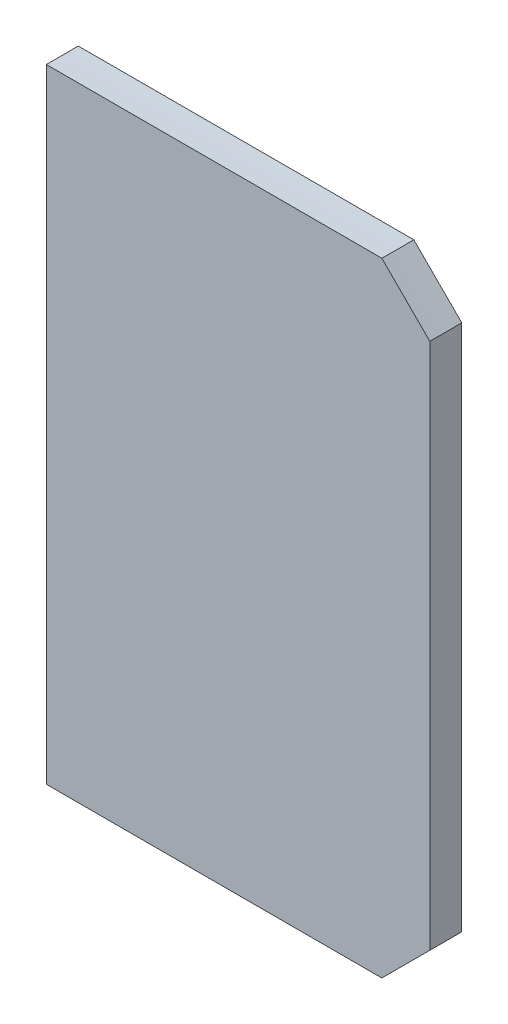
ISO-10303-21;
HEADER;
FILE_DESCRIPTION(('STEP AP214'),'2;1');
FILE_NAME('part.step','',(''),(''),'','','');
FILE_SCHEMA(('AUTOMOTIVE_DESIGN { 1 0 10303 214 1 1 1 1 }'));
ENDSEC;
DATA;
#1=APPLICATION_CONTEXT('core data for automotive mechanical design processes');
#2=APPLICATION_PROTOCOL_DEFINITION('international standard','automotive_design',2000,#1);
#3=PRODUCT_CONTEXT('',#1,'mechanical');
#4=PRODUCT('Part','Part','',(#3));
#5=PRODUCT_RELATED_PRODUCT_CATEGORY('part','',(#4));
#6=PRODUCT_DEFINITION_FORMATION('','',#4);
#7=PRODUCT_DEFINITION_CONTEXT('part definition',#1,'design');
#8=PRODUCT_DEFINITION('design','',#6,#7);
#9=PRODUCT_DEFINITION_SHAPE('','',#8);
#10=(LENGTH_UNIT() NAMED_UNIT(*) SI_UNIT(.MILLI.,.METRE.));
#11=(NAMED_UNIT(*) PLANE_ANGLE_UNIT() SI_UNIT($,.RADIAN.));
#12=(NAMED_UNIT(*) SI_UNIT($,.STERADIAN.) SOLID_ANGLE_UNIT());
#13=UNCERTAINTY_MEASURE_WITH_UNIT(LENGTH_MEASURE(1.E-05),#10,'distance_accuracy_value','');
#14=(GEOMETRIC_REPRESENTATION_CONTEXT(3) GLOBAL_UNCERTAINTY_ASSIGNED_CONTEXT((#13)) GLOBAL_UNIT_ASSIGNED_CONTEXT((#10,
#11,#12)) REPRESENTATION_CONTEXT('',''));
#15=CARTESIAN_POINT('',(0.,0.,0.));
#16=DIRECTION('',(0.,0.,1.));
#17=DIRECTION('',(1.,0.,0.));
#18=AXIS2_PLACEMENT_3D('',#15,#16,#17);
#19=CARTESIAN_POINT('',(275.,-510.,5.));
#20=DIRECTION('',(0.,1.,0.));
#21=DIRECTION('',(0.,0.,1.));
#22=AXIS2_PLACEMENT_3D('',#19,#20,#21);
#23=PLANE('',#22);
#24=DIRECTION('',(-1.,0.,0.));
#25=VECTOR('',#24,1.);
#26=CARTESIAN_POINT('',(275.,-510.,-5.));
#27=LINE('',#26,#25);
#28=CARTESIAN_POINT('',(380.,-510.,-5.));
#29=VERTEX_POINT('',#28);
#30=CARTESIAN_POINT('',(275.,-510.,-5.));
#31=VERTEX_POINT('',#30);
#32=EDGE_CURVE('E116',#29,#31,#27,.T.);
#33=ORIENTED_EDGE('',*,*,#32,.F.);
#34=DIRECTION('',(0.,0.,1.));
#35=VECTOR('',#34,1.);
#36=CARTESIAN_POINT('',(380.,-510.,5.));
#37=LINE('',#36,#35);
#38=CARTESIAN_POINT('',(380.,-510.,5.));
#39=VERTEX_POINT('',#38);
#40=EDGE_CURVE('E13',#29,#39,#37,.T.);
#41=ORIENTED_EDGE('',*,*,#40,.T.);
#42=DIRECTION('',(1.,0.,0.));
#43=VECTOR('',#42,1.);
#44=CARTESIAN_POINT('',(275.,-510.,5.));
#45=LINE('',#44,#43);
#46=CARTESIAN_POINT('',(275.,-510.,5.));
#47=VERTEX_POINT('',#46);
#48=EDGE_CURVE('E102',#47,#39,#45,.T.);
#49=ORIENTED_EDGE('',*,*,#48,.F.);
#50=DIRECTION('',(0.,0.,1.));
#51=VECTOR('',#50,1.);
#52=CARTESIAN_POINT('',(275.,-510.,-5.));
#53=LINE('',#52,#51);
#54=EDGE_CURVE('E114',#31,#47,#53,.T.);
#55=ORIENTED_EDGE('',*,*,#54,.F.);
#56=EDGE_LOOP('',(#33,#41,#49,#55));
#57=FACE_BOUND('',#56,.T.);
#58=ADVANCED_FACE('F45',(#57),#23,.F.);
#59=CARTESIAN_POINT('',(275.,-133.123752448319,-5.));
#60=DIRECTION('',(0.,0.,1.));
#61=DIRECTION('',(1.,0.,0.));
#62=AXIS2_PLACEMENT_3D('',#59,#60,#61);
#63=PLANE('',#62);
#64=DIRECTION('',(1.,0.,0.));
#65=VECTOR('',#64,1.);
#66=CARTESIAN_POINT('',(260.,-314.960314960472,-5.));
#67=LINE('',#66,#65);
#68=CARTESIAN_POINT('',(275.,-314.960314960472,-5.));
#69=VERTEX_POINT('',#68);
#70=CARTESIAN_POINT('',(380.,-314.960314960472,-5.));
#71=VERTEX_POINT('',#70);
#72=EDGE_CURVE('E109',#69,#71,#67,.T.);
#73=ORIENTED_EDGE('',*,*,#72,.T.);
#74=CARTESIAN_POINT('',(380.,-314.960314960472,-5.));
#75=CARTESIAN_POINT('',(382.49999300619,-317.460622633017,-5.));
#76=CARTESIAN_POINT('',(384.999989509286,-319.960926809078,-5.));
#77=CARTESIAN_POINT('',(389.999989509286,-324.96152816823,-5.00000000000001));
#78=CARTESIAN_POINT('',(392.49999300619,-327.461825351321,-5.00000000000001));
#79=CARTESIAN_POINT('',(395.,-329.962119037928,-5.));
#80=B_SPLINE_CURVE_WITH_KNOTS('',3,(#74,#75,#76,#77,#78,#79),.UNSPECIFIED.,.F.,.F.,(4,2,4),(0.,
10.6072395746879,21.2144791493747),.UNSPECIFIED.);
#81=CARTESIAN_POINT('',(395.,-329.962119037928,-5.));
#82=VERTEX_POINT('',#81);
#83=EDGE_CURVE('E53',#71,#82,#80,.T.);
#84=ORIENTED_EDGE('',*,*,#83,.T.);
#85=DIRECTION('',(0.,-1.,0.));
#86=VECTOR('',#85,1.);
#87=CARTESIAN_POINT('',(395.,-133.123752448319,-5.));
#88=LINE('',#87,#86);
#89=CARTESIAN_POINT('',(395.,-495.,-5.));
#90=VERTEX_POINT('',#89);
#91=EDGE_CURVE('E129',#82,#90,#88,.T.);
#92=ORIENTED_EDGE('',*,*,#91,.T.);
#93=DIRECTION('',(0.707106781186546,0.707106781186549,0.));
#94=VECTOR('',#93,1.);
#95=CARTESIAN_POINT('',(395.,-495.,-5.));
#96=LINE('',#95,#94);
#97=EDGE_CURVE('E60',#90,#29,#96,.F.);
#98=ORIENTED_EDGE('',*,*,#97,.T.);
#99=ORIENTED_EDGE('',*,*,#32,.T.);
#100=DIRECTION('',(0.,-1.,0.));
#101=VECTOR('',#100,1.);
#102=CARTESIAN_POINT('',(275.,-133.123752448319,-5.));
#103=LINE('',#102,#101);
#104=EDGE_CURVE('E121',#69,#31,#103,.T.);
#105=ORIENTED_EDGE('',*,*,#104,.F.);
#106=EDGE_LOOP('',(#73,#84,#92,#98,#99,#105));
#107=FACE_BOUND('',#106,.T.);
#108=ADVANCED_FACE('F164',(#107),#63,.F.);
#109=CARTESIAN_POINT('',(395.,-133.123752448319,-5.));
#110=DIRECTION('',(-1.,0.,0.));
#111=DIRECTION('',(0.,0.,1.));
#112=AXIS2_PLACEMENT_3D('',#109,#110,#111);
#113=PLANE('',#112);
#114=ORIENTED_EDGE('',*,*,#91,.F.);
#115=CARTESIAN_POINT('',(395.,0.,0.));
#116=DIRECTION('',(-1.,0.,0.));
#117=DIRECTION('',(0.,0.,1.));
#118=AXIS2_PLACEMENT_3D('',#115,#116,#117);
#119=CIRCLE('',#118,330.);
#120=CARTESIAN_POINT('',(395.,-329.962119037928,5.));
#121=VERTEX_POINT('',#120);
#122=EDGE_CURVE('E137',#82,#121,#119,.T.);
#123=ORIENTED_EDGE('',*,*,#122,.T.);
#124=DIRECTION('',(0.,-1.,0.));
#125=VECTOR('',#124,1.);
#126=CARTESIAN_POINT('',(395.,-133.123752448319,5.));
#127=LINE('',#126,#125);
#128=CARTESIAN_POINT('',(395.,-495.,5.));
#129=VERTEX_POINT('',#128);
#130=EDGE_CURVE('E110',#121,#129,#127,.T.);
#131=ORIENTED_EDGE('',*,*,#130,.T.);
#132=DIRECTION('',(0.,0.,-1.));
#133=VECTOR('',#132,1.);
#134=CARTESIAN_POINT('',(395.,-495.,-5.));
#135=LINE('',#134,#133);
#136=EDGE_CURVE('E134',#129,#90,#135,.T.);
#137=ORIENTED_EDGE('',*,*,#136,.T.);
#138=EDGE_LOOP('',(#114,#123,#131,#137));
#139=FACE_BOUND('',#138,.T.);
#140=ADVANCED_FACE('F155',(#139),#113,.F.);
#141=CARTESIAN_POINT('',(275.,-133.123752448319,5.));
#142=DIRECTION('',(0.,0.,-1.));
#143=DIRECTION('',(-1.,0.,0.));
#144=AXIS2_PLACEMENT_3D('',#141,#142,#143);
#145=PLANE('',#144);
#146=ORIENTED_EDGE('',*,*,#130,.F.);
#147=CARTESIAN_POINT('',(395.,-329.962119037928,5.));
#148=CARTESIAN_POINT('',(392.49999300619,-327.461825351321,5.));
#149=CARTESIAN_POINT('',(389.999989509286,-324.96152816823,5.));
#150=CARTESIAN_POINT('',(384.999989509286,-319.960926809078,5.));
#151=CARTESIAN_POINT('',(382.49999300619,-317.460622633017,5.));
#152=CARTESIAN_POINT('',(380.,-314.960314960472,5.));
#153=B_SPLINE_CURVE_WITH_KNOTS('',3,(#147,#148,#149,#150,#151,#152),.UNSPECIFIED.,.F.,.F.,(4,2,
4),(0.,10.6072395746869,21.2144791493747),.UNSPECIFIED.);
#154=CARTESIAN_POINT('',(380.,-314.960314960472,5.));
#155=VERTEX_POINT('',#154);
#156=EDGE_CURVE('E142',#121,#155,#153,.T.);
#157=ORIENTED_EDGE('',*,*,#156,.T.);
#158=DIRECTION('',(1.,0.,0.));
#159=VECTOR('',#158,1.);
#160=CARTESIAN_POINT('',(260.,-314.960314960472,5.));
#161=LINE('',#160,#159);
#162=CARTESIAN_POINT('',(275.,-314.960314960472,5.));
#163=VERTEX_POINT('',#162);
#164=EDGE_CURVE('E104',#155,#163,#161,.F.);
#165=ORIENTED_EDGE('',*,*,#164,.T.);
#166=DIRECTION('',(0.,-1.,0.));
#167=VECTOR('',#166,1.);
#168=CARTESIAN_POINT('',(275.,-133.123752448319,5.));
#169=LINE('',#168,#167);
#170=EDGE_CURVE('E98',#163,#47,#169,.T.);
#171=ORIENTED_EDGE('',*,*,#170,.T.);
#172=ORIENTED_EDGE('',*,*,#48,.T.);
#173=DIRECTION('',(-0.707106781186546,-0.707106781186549,0.));
#174=VECTOR('',#173,1.);
#175=CARTESIAN_POINT('',(395.,-495.,5.));
#176=LINE('',#175,#174);
#177=EDGE_CURVE('E140',#39,#129,#176,.F.);
#178=ORIENTED_EDGE('',*,*,#177,.T.);
#179=EDGE_LOOP('',(#146,#157,#165,#171,#172,#178));
#180=FACE_BOUND('',#179,.T.);
#181=ADVANCED_FACE('F101',(#180),#145,.F.);
#182=CARTESIAN_POINT('',(275.,-133.123752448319,-5.));
#183=DIRECTION('',(1.,0.,0.));
#184=DIRECTION('',(0.,0.,-1.));
#185=AXIS2_PLACEMENT_3D('',#182,#183,#184);
#186=PLANE('',#185);
#187=ORIENTED_EDGE('',*,*,#170,.F.);
#188=CARTESIAN_POINT('',(275.,0.,0.));
#189=DIRECTION('',(1.,0.,0.));
#190=DIRECTION('',(0.,0.,-1.));
#191=AXIS2_PLACEMENT_3D('',#188,#189,#190);
#192=CIRCLE('',#191,315.);
#193=EDGE_CURVE('E124',#163,#69,#192,.T.);
#194=ORIENTED_EDGE('',*,*,#193,.T.);
#195=ORIENTED_EDGE('',*,*,#104,.T.);
#196=ORIENTED_EDGE('',*,*,#54,.T.);
#197=EDGE_LOOP('',(#187,#194,#195,#196));
#198=FACE_BOUND('',#197,.T.);
#199=ADVANCED_FACE('F119',(#198),#186,.F.);
#200=CARTESIAN_POINT('',(260.,0.,0.));
#201=DIRECTION('',(1.,0.,0.));
#202=DIRECTION('',(0.,0.,-1.));
#203=AXIS2_PLACEMENT_3D('',#200,#201,#202);
#204=CYLINDRICAL_SURFACE('',#203,315.);
#205=ORIENTED_EDGE('',*,*,#164,.F.);
#206=CARTESIAN_POINT('',(380.,0.,0.));
#207=DIRECTION('',(-1.,0.,0.));
#208=DIRECTION('',(0.,0.,1.));
#209=AXIS2_PLACEMENT_3D('',#206,#207,#208);
#210=CIRCLE('',#209,315.);
#211=EDGE_CURVE('E68',#155,#71,#210,.F.);
#212=ORIENTED_EDGE('',*,*,#211,.T.);
#213=ORIENTED_EDGE('',*,*,#72,.F.);
#214=ORIENTED_EDGE('',*,*,#193,.F.);
#215=EDGE_LOOP('',(#205,#212,#213,#214));
#216=FACE_BOUND('',#215,.T.);
#217=ADVANCED_FACE('F158',(#216),#204,.F.);
#218=CARTESIAN_POINT('',(395.,0.,0.));
#219=DIRECTION('',(1.,0.,0.));
#220=DIRECTION('',(0.,0.,-1.));
#221=AXIS2_PLACEMENT_3D('',#218,#219,#220);
#222=CONICAL_SURFACE('',#221,330.,0.785398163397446);
#223=ORIENTED_EDGE('',*,*,#83,.F.);
#224=ORIENTED_EDGE('',*,*,#211,.F.);
#225=ORIENTED_EDGE('',*,*,#156,.F.);
#226=ORIENTED_EDGE('',*,*,#122,.F.);
#227=EDGE_LOOP('',(#223,#224,#225,#226));
#228=FACE_BOUND('',#227,.T.);
#229=ADVANCED_FACE('F149',(#228),#222,.F.);
#230=CARTESIAN_POINT('',(395.,-495.,-5.));
#231=DIRECTION('',(-0.707106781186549,0.707106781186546,0.));
#232=DIRECTION('',(-0.707106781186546,-0.707106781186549,0.));
#233=AXIS2_PLACEMENT_3D('',#230,#231,#232);
#234=PLANE('',#233);
#235=ORIENTED_EDGE('',*,*,#177,.F.);
#236=ORIENTED_EDGE('',*,*,#40,.F.);
#237=ORIENTED_EDGE('',*,*,#97,.F.);
#238=ORIENTED_EDGE('',*,*,#136,.F.);
#239=EDGE_LOOP('',(#235,#236,#237,#238));
#240=FACE_BOUND('',#239,.T.);
#241=ADVANCED_FACE('F47',(#240),#234,.F.);
#242=CLOSED_SHELL('',(#58,#108,#140,#181,#199,#217,#229,#241));
#243=MANIFOLD_SOLID_BREP('B2',#242);
#244=ADVANCED_BREP_SHAPE_REPRESENTATION('',(#18,#243),#14);
#245=SHAPE_DEFINITION_REPRESENTATION(#9,#244);
ENDSEC;
END-ISO-10303-21;
